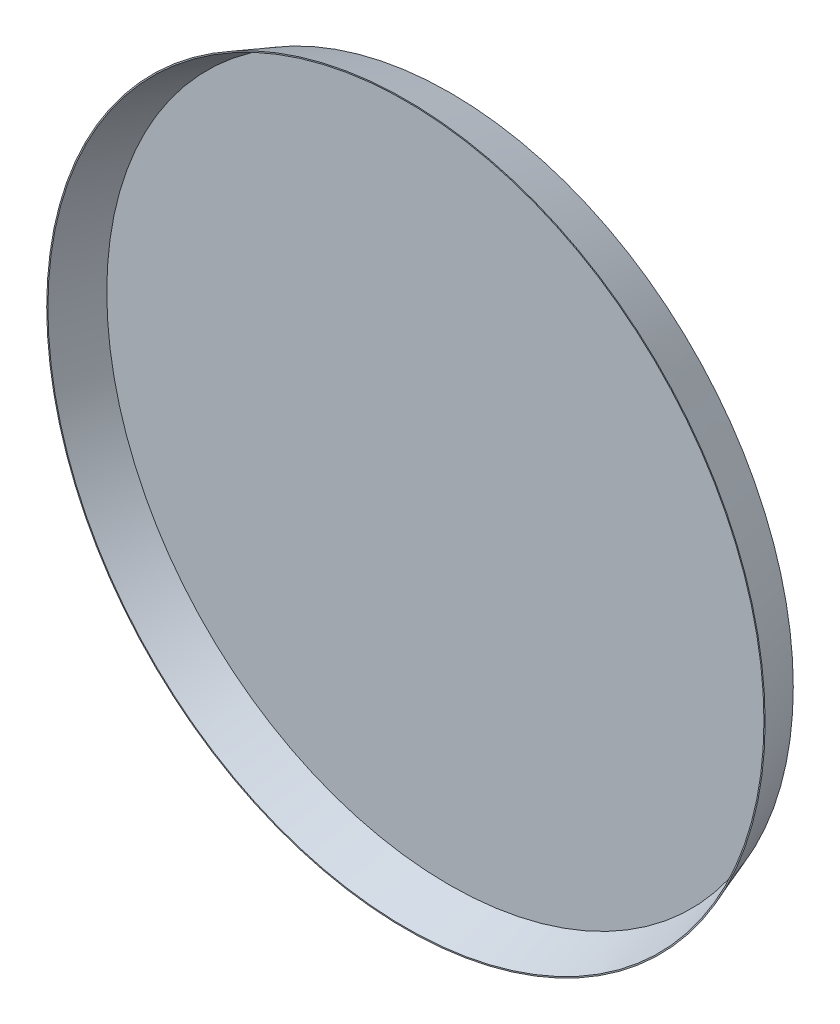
ISO-10303-21;
HEADER;
FILE_DESCRIPTION(('STEP AP214'),'2;1');
FILE_NAME('part.step','',(''),(''),'','','');
FILE_SCHEMA(('AUTOMOTIVE_DESIGN { 1 0 10303 214 1 1 1 1 }'));
ENDSEC;
DATA;
#1=APPLICATION_CONTEXT('core data for automotive mechanical design processes');
#2=APPLICATION_PROTOCOL_DEFINITION('international standard','automotive_design',2000,#1);
#3=PRODUCT_CONTEXT('',#1,'mechanical');
#4=PRODUCT('Part','Part','',(#3));
#5=PRODUCT_RELATED_PRODUCT_CATEGORY('part','',(#4));
#6=PRODUCT_DEFINITION_FORMATION('','',#4);
#7=PRODUCT_DEFINITION_CONTEXT('part definition',#1,'design');
#8=PRODUCT_DEFINITION('design','',#6,#7);
#9=PRODUCT_DEFINITION_SHAPE('','',#8);
#10=(LENGTH_UNIT() NAMED_UNIT(*) SI_UNIT(.MILLI.,.METRE.));
#11=(NAMED_UNIT(*) PLANE_ANGLE_UNIT() SI_UNIT($,.RADIAN.));
#12=(NAMED_UNIT(*) SI_UNIT($,.STERADIAN.) SOLID_ANGLE_UNIT());
#13=UNCERTAINTY_MEASURE_WITH_UNIT(LENGTH_MEASURE(1.E-05),#10,'distance_accuracy_value','');
#14=(GEOMETRIC_REPRESENTATION_CONTEXT(3) GLOBAL_UNCERTAINTY_ASSIGNED_CONTEXT((#13)) GLOBAL_UNIT_ASSIGNED_CONTEXT((#10,
#11,#12)) REPRESENTATION_CONTEXT('',''));
#15=CARTESIAN_POINT('',(0.,0.,0.));
#16=DIRECTION('',(0.,0.,1.));
#17=DIRECTION('',(1.,0.,0.));
#18=AXIS2_PLACEMENT_3D('',#15,#16,#17);
#19=CARTESIAN_POINT('',(0.,0.,0.));
#20=DIRECTION('',(0.,0.,1.));
#21=DIRECTION('',(1.,0.,0.));
#22=AXIS2_PLACEMENT_3D('',#19,#20,#21);
#23=CONICAL_SURFACE('',#22,15.5,0.349065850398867);
#24=CARTESIAN_POINT('',(0.,0.,2.));
#25=DIRECTION('',(0.,0.,1.));
#26=DIRECTION('',(1.,0.,0.));
#27=AXIS2_PLACEMENT_3D('',#24,#25,#26);
#28=CIRCLE('',#27,16.2279404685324);
#29=CARTESIAN_POINT('',(16.2279404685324,0.,2.));
#30=VERTEX_POINT('',#29);
#31=EDGE_CURVE('E10',#30,#30,#28,.T.);
#32=ORIENTED_EDGE('',*,*,#31,.F.);
#33=EDGE_LOOP('',(#32));
#34=FACE_BOUND('',#33,.T.);
#35=CARTESIAN_POINT('',(0.,0.,0.));
#36=DIRECTION('',(0.,0.,1.));
#37=DIRECTION('',(1.,0.,0.));
#38=AXIS2_PLACEMENT_3D('',#35,#36,#37);
#39=CIRCLE('',#38,15.5);
#40=CARTESIAN_POINT('',(15.5,0.,0.));
#41=VERTEX_POINT('',#40);
#42=EDGE_CURVE('E38',#41,#41,#39,.T.);
#43=ORIENTED_EDGE('',*,*,#42,.T.);
#44=EDGE_LOOP('',(#43));
#45=FACE_BOUND('',#44,.T.);
#46=ADVANCED_FACE('F32',(#34,#45),#23,.T.);
#47=CARTESIAN_POINT('',(0.,0.,2.));
#48=DIRECTION('',(0.,0.,1.));
#49=DIRECTION('',(1.,0.,0.));
#50=AXIS2_PLACEMENT_3D('',#47,#48,#49);
#51=PLANE('',#50);
#52=CARTESIAN_POINT('',(0.,0.,2.));
#53=DIRECTION('',(0.,0.,1.));
#54=DIRECTION('',(1.,0.,0.));
#55=AXIS2_PLACEMENT_3D('',#52,#53,#54);
#56=CIRCLE('',#55,16.1747315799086);
#57=CARTESIAN_POINT('',(16.1747315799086,0.,2.));
#58=VERTEX_POINT('',#57);
#59=EDGE_CURVE('E42',#58,#58,#56,.T.);
#60=ORIENTED_EDGE('',*,*,#59,.F.);
#61=EDGE_LOOP('',(#60));
#62=FACE_BOUND('',#61,.T.);
#63=ORIENTED_EDGE('',*,*,#31,.T.);
#64=EDGE_LOOP('',(#63));
#65=FACE_BOUND('',#64,.T.);
#66=ADVANCED_FACE('F64',(#62,#65),#51,.T.);
#67=CARTESIAN_POINT('',(0.,0.,0.));
#68=DIRECTION('',(0.,0.,1.));
#69=DIRECTION('',(1.,0.,0.));
#70=AXIS2_PLACEMENT_3D('',#67,#68,#69);
#71=PLANE('',#70);
#72=ORIENTED_EDGE('',*,*,#42,.F.);
#73=EDGE_LOOP('',(#72));
#74=FACE_BOUND('',#73,.T.);
#75=ADVANCED_FACE('F56',(#74),#71,.F.);
#76=CARTESIAN_POINT('',(0.,0.,0.0171010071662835));
#77=DIRECTION('',(0.,0.,1.));
#78=DIRECTION('',(1.,0.,0.));
#79=AXIS2_PLACEMENT_3D('',#76,#77,#78);
#80=CONICAL_SURFACE('',#79,15.4530153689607,0.349065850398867);
#81=ORIENTED_EDGE('',*,*,#59,.T.);
#82=EDGE_LOOP('',(#81));
#83=FACE_BOUND('',#82,.T.);
#84=CARTESIAN_POINT('',(0.,0.,0.05));
#85=DIRECTION('',(0.,0.,1.));
#86=DIRECTION('',(1.,0.,0.));
#87=AXIS2_PLACEMENT_3D('',#84,#85,#86);
#88=CIRCLE('',#87,15.4649896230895);
#89=CARTESIAN_POINT('',(15.4649896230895,0.,0.05));
#90=VERTEX_POINT('',#89);
#91=EDGE_CURVE('E46',#90,#90,#88,.T.);
#92=ORIENTED_EDGE('',*,*,#91,.F.);
#93=EDGE_LOOP('',(#92));
#94=FACE_BOUND('',#93,.T.);
#95=ADVANCED_FACE('F54',(#83,#94),#80,.F.);
#96=CARTESIAN_POINT('',(0.,0.,0.05));
#97=DIRECTION('',(0.,0.,1.));
#98=DIRECTION('',(1.,0.,0.));
#99=AXIS2_PLACEMENT_3D('',#96,#97,#98);
#100=PLANE('',#99);
#101=ORIENTED_EDGE('',*,*,#91,.T.);
#102=EDGE_LOOP('',(#101));
#103=FACE_BOUND('',#102,.T.);
#104=ADVANCED_FACE('F52',(#103),#100,.T.);
#105=CLOSED_SHELL('',(#46,#66,#75,#95,#104));
#106=MANIFOLD_SOLID_BREP('B2',#105);
#107=ADVANCED_BREP_SHAPE_REPRESENTATION('',(#18,#106),#14);
#108=SHAPE_DEFINITION_REPRESENTATION(#9,#107);
ENDSEC;
END-ISO-10303-21;
